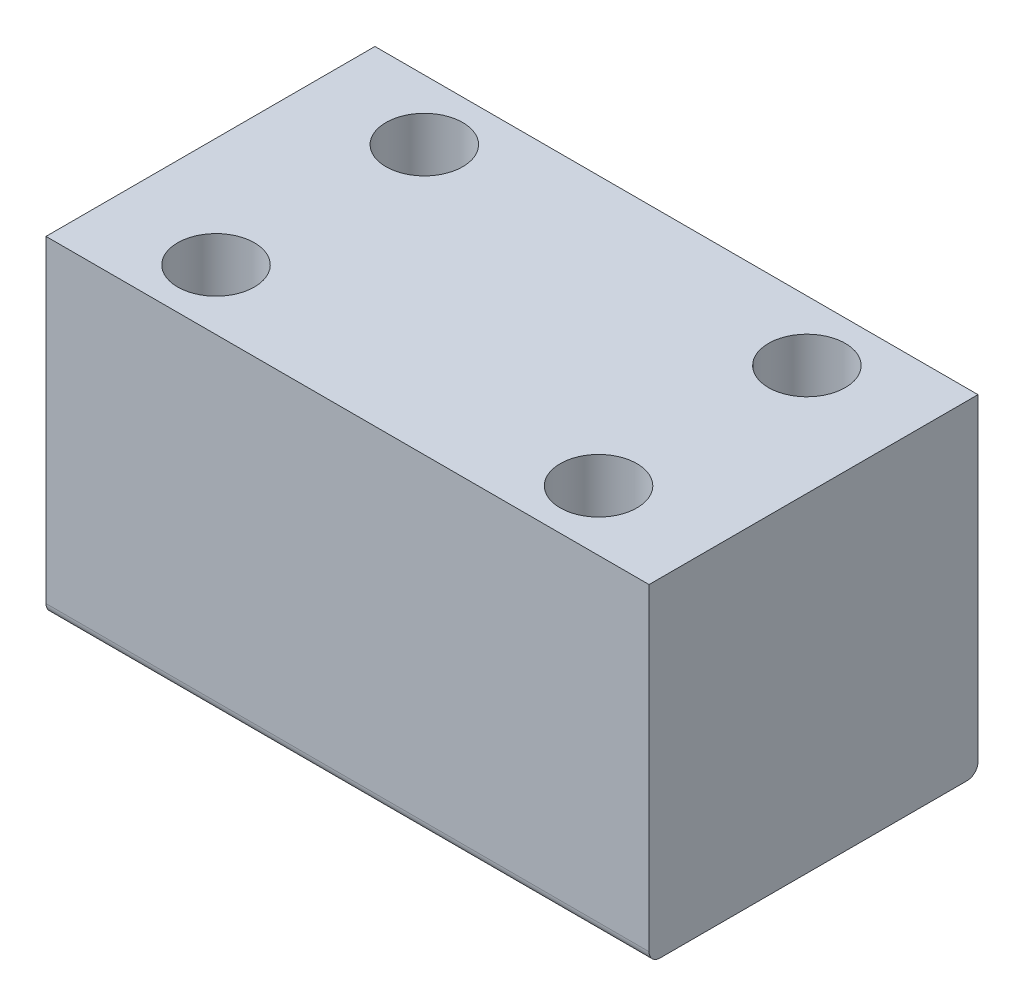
ISO-10303-21;
HEADER;
FILE_DESCRIPTION(('STEP AP214'),'2;1');
FILE_NAME('part.step','',(''),(''),'','','');
FILE_SCHEMA(('AUTOMOTIVE_DESIGN { 1 0 10303 214 1 1 1 1 }'));
ENDSEC;
DATA;
#1=APPLICATION_CONTEXT('core data for automotive mechanical design processes');
#2=APPLICATION_PROTOCOL_DEFINITION('international standard','automotive_design',2000,#1);
#3=PRODUCT_CONTEXT('',#1,'mechanical');
#4=PRODUCT('Part','Part','',(#3));
#5=PRODUCT_RELATED_PRODUCT_CATEGORY('part','',(#4));
#6=PRODUCT_DEFINITION_FORMATION('','',#4);
#7=PRODUCT_DEFINITION_CONTEXT('part definition',#1,'design');
#8=PRODUCT_DEFINITION('design','',#6,#7);
#9=PRODUCT_DEFINITION_SHAPE('','',#8);
#10=(LENGTH_UNIT() NAMED_UNIT(*) SI_UNIT(.MILLI.,.METRE.));
#11=(NAMED_UNIT(*) PLANE_ANGLE_UNIT() SI_UNIT($,.RADIAN.));
#12=(NAMED_UNIT(*) SI_UNIT($,.STERADIAN.) SOLID_ANGLE_UNIT());
#13=UNCERTAINTY_MEASURE_WITH_UNIT(LENGTH_MEASURE(1.E-05),#10,'distance_accuracy_value','');
#14=(GEOMETRIC_REPRESENTATION_CONTEXT(3) GLOBAL_UNCERTAINTY_ASSIGNED_CONTEXT((#13)) GLOBAL_UNIT_ASSIGNED_CONTEXT((#10,
#11,#12)) REPRESENTATION_CONTEXT('',''));
#15=CARTESIAN_POINT('',(0.,0.,0.));
#16=DIRECTION('',(0.,0.,1.));
#17=DIRECTION('',(1.,0.,0.));
#18=AXIS2_PLACEMENT_3D('',#15,#16,#17);
#19=CARTESIAN_POINT('',(55.,-15.,15.));
#20=DIRECTION('',(0.,1.,0.));
#21=DIRECTION('',(0.,0.,1.));
#22=AXIS2_PLACEMENT_3D('',#19,#20,#21);
#23=PLANE('',#22);
#24=DIRECTION('',(0.,0.,-1.));
#25=VECTOR('',#24,1.);
#26=CARTESIAN_POINT('',(0.,-15.,15.));
#27=LINE('',#26,#25);
#28=CARTESIAN_POINT('',(0.,-15.,14.));
#29=VERTEX_POINT('',#28);
#30=CARTESIAN_POINT('',(0.,-15.,-14.));
#31=VERTEX_POINT('',#30);
#32=EDGE_CURVE('E141',#29,#31,#27,.T.);
#33=ORIENTED_EDGE('',*,*,#32,.T.);
#34=DIRECTION('',(-1.,0.,0.));
#35=VECTOR('',#34,1.);
#36=CARTESIAN_POINT('',(55.,-15.,-14.));
#37=LINE('',#36,#35);
#38=CARTESIAN_POINT('',(55.,-15.,-14.));
#39=VERTEX_POINT('',#38);
#40=EDGE_CURVE('E44',#31,#39,#37,.F.);
#41=ORIENTED_EDGE('',*,*,#40,.T.);
#42=DIRECTION('',(0.,0.,-1.));
#43=VECTOR('',#42,1.);
#44=CARTESIAN_POINT('',(55.,-15.,15.));
#45=LINE('',#44,#43);
#46=CARTESIAN_POINT('',(55.,-15.,14.));
#47=VERTEX_POINT('',#46);
#48=EDGE_CURVE('E142',#47,#39,#45,.T.);
#49=ORIENTED_EDGE('',*,*,#48,.F.);
#50=DIRECTION('',(-1.,0.,0.));
#51=VECTOR('',#50,1.);
#52=CARTESIAN_POINT('',(0.,-15.,14.));
#53=LINE('',#52,#51);
#54=EDGE_CURVE('E165',#47,#29,#53,.T.);
#55=ORIENTED_EDGE('',*,*,#54,.T.);
#56=EDGE_LOOP('',(#33,#41,#49,#55));
#57=FACE_BOUND('',#56,.T.);
#58=ADVANCED_FACE('F36',(#57),#23,.F.);
#59=CARTESIAN_POINT('',(55.,-15.,-15.));
#60=DIRECTION('',(0.,0.,1.));
#61=DIRECTION('',(1.,0.,0.));
#62=AXIS2_PLACEMENT_3D('',#59,#60,#61);
#63=PLANE('',#62);
#64=DIRECTION('',(0.,1.,0.));
#65=VECTOR('',#64,1.);
#66=CARTESIAN_POINT('',(55.,-15.,-15.));
#67=LINE('',#66,#65);
#68=CARTESIAN_POINT('',(55.,-14.,-15.));
#69=VERTEX_POINT('',#68);
#70=CARTESIAN_POINT('',(55.,15.,-15.));
#71=VERTEX_POINT('',#70);
#72=EDGE_CURVE('E144',#69,#71,#67,.T.);
#73=ORIENTED_EDGE('',*,*,#72,.F.);
#74=DIRECTION('',(-1.,0.,0.));
#75=VECTOR('',#74,1.);
#76=CARTESIAN_POINT('',(55.,-14.,-15.));
#77=LINE('',#76,#75);
#78=CARTESIAN_POINT('',(0.,-14.,-15.));
#79=VERTEX_POINT('',#78);
#80=EDGE_CURVE('E174',#69,#79,#77,.T.);
#81=ORIENTED_EDGE('',*,*,#80,.T.);
#82=DIRECTION('',(0.,1.,0.));
#83=VECTOR('',#82,1.);
#84=CARTESIAN_POINT('',(0.,-15.,-15.));
#85=LINE('',#84,#83);
#86=CARTESIAN_POINT('',(0.,15.,-15.));
#87=VERTEX_POINT('',#86);
#88=EDGE_CURVE('E154',#79,#87,#85,.T.);
#89=ORIENTED_EDGE('',*,*,#88,.T.);
#90=DIRECTION('',(-1.,0.,0.));
#91=VECTOR('',#90,1.);
#92=CARTESIAN_POINT('',(55.,15.,-15.));
#93=LINE('',#92,#91);
#94=EDGE_CURVE('E162',#71,#87,#93,.T.);
#95=ORIENTED_EDGE('',*,*,#94,.F.);
#96=EDGE_LOOP('',(#73,#81,#89,#95));
#97=FACE_BOUND('',#96,.T.);
#98=ADVANCED_FACE('F180',(#97),#63,.F.);
#99=CARTESIAN_POINT('',(55.,15.,15.));
#100=DIRECTION('',(0.,1.,0.));
#101=DIRECTION('',(0.,0.,1.));
#102=AXIS2_PLACEMENT_3D('',#99,#100,#101);
#103=PLANE('',#102);
#104=CARTESIAN_POINT('',(10.0050881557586,15.,-9.5));
#105=DIRECTION('',(0.,1.,0.));
#106=DIRECTION('',(0.,0.,1.));
#107=AXIS2_PLACEMENT_3D('',#104,#105,#106);
#108=CIRCLE('',#107,3.49999999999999);
#109=CARTESIAN_POINT('',(10.0050881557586,15.,-6.00000000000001));
#110=VERTEX_POINT('',#109);
#111=EDGE_CURVE('E113',#110,#110,#108,.T.);
#112=ORIENTED_EDGE('',*,*,#111,.F.);
#113=EDGE_LOOP('',(#112));
#114=FACE_BOUND('',#113,.T.);
#115=CARTESIAN_POINT('',(10.0050881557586,15.,9.5));
#116=DIRECTION('',(0.,1.,0.));
#117=DIRECTION('',(0.,0.,1.));
#118=AXIS2_PLACEMENT_3D('',#115,#116,#117);
#119=CIRCLE('',#118,3.49999999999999);
#120=CARTESIAN_POINT('',(10.0050881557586,15.,13.));
#121=VERTEX_POINT('',#120);
#122=EDGE_CURVE('E112',#121,#121,#119,.T.);
#123=ORIENTED_EDGE('',*,*,#122,.F.);
#124=EDGE_LOOP('',(#123));
#125=FACE_BOUND('',#124,.T.);
#126=CARTESIAN_POINT('',(44.8952061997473,15.,9.5));
#127=DIRECTION('',(0.,1.,0.));
#128=DIRECTION('',(0.,0.,1.));
#129=AXIS2_PLACEMENT_3D('',#126,#127,#128);
#130=CIRCLE('',#129,3.49999999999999);
#131=CARTESIAN_POINT('',(44.8952061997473,15.,13.));
#132=VERTEX_POINT('',#131);
#133=EDGE_CURVE('E123',#132,#132,#130,.T.);
#134=ORIENTED_EDGE('',*,*,#133,.F.);
#135=EDGE_LOOP('',(#134));
#136=FACE_BOUND('',#135,.T.);
#137=CARTESIAN_POINT('',(44.8952061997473,15.,-9.5));
#138=DIRECTION('',(0.,1.,0.));
#139=DIRECTION('',(0.,0.,1.));
#140=AXIS2_PLACEMENT_3D('',#137,#138,#139);
#141=CIRCLE('',#140,3.49999999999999);
#142=CARTESIAN_POINT('',(44.8952061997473,15.,-6.00000000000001));
#143=VERTEX_POINT('',#142);
#144=EDGE_CURVE('E129',#143,#143,#141,.T.);
#145=ORIENTED_EDGE('',*,*,#144,.F.);
#146=EDGE_LOOP('',(#145));
#147=FACE_BOUND('',#146,.T.);
#148=DIRECTION('',(0.,0.,-1.));
#149=VECTOR('',#148,1.);
#150=CARTESIAN_POINT('',(0.,15.,15.));
#151=LINE('',#150,#149);
#152=CARTESIAN_POINT('',(0.,15.,15.));
#153=VERTEX_POINT('',#152);
#154=EDGE_CURVE('E156',#153,#87,#151,.T.);
#155=ORIENTED_EDGE('',*,*,#154,.F.);
#156=DIRECTION('',(-1.,0.,0.));
#157=VECTOR('',#156,1.);
#158=CARTESIAN_POINT('',(55.,15.,15.));
#159=LINE('',#158,#157);
#160=CARTESIAN_POINT('',(55.,15.,15.));
#161=VERTEX_POINT('',#160);
#162=EDGE_CURVE('E152',#161,#153,#159,.T.);
#163=ORIENTED_EDGE('',*,*,#162,.F.);
#164=DIRECTION('',(0.,0.,-1.));
#165=VECTOR('',#164,1.);
#166=CARTESIAN_POINT('',(55.,15.,15.));
#167=LINE('',#166,#165);
#168=EDGE_CURVE('E147',#161,#71,#167,.T.);
#169=ORIENTED_EDGE('',*,*,#168,.T.);
#170=ORIENTED_EDGE('',*,*,#94,.T.);
#171=EDGE_LOOP('',(#155,#163,#169,#170));
#172=FACE_BOUND('',#171,.T.);
#173=ADVANCED_FACE('F189',(#114,#125,#136,#147,#172),#103,.T.);
#174=CARTESIAN_POINT('',(55.,-15.,15.));
#175=DIRECTION('',(0.,0.,1.));
#176=DIRECTION('',(1.,0.,0.));
#177=AXIS2_PLACEMENT_3D('',#174,#175,#176);
#178=PLANE('',#177);
#179=DIRECTION('',(0.,1.,0.));
#180=VECTOR('',#179,1.);
#181=CARTESIAN_POINT('',(0.,-15.,15.));
#182=LINE('',#181,#180);
#183=CARTESIAN_POINT('',(0.,-14.,15.));
#184=VERTEX_POINT('',#183);
#185=EDGE_CURVE('E145',#184,#153,#182,.T.);
#186=ORIENTED_EDGE('',*,*,#185,.F.);
#187=DIRECTION('',(-1.,0.,0.));
#188=VECTOR('',#187,1.);
#189=CARTESIAN_POINT('',(55.,-14.,15.));
#190=LINE('',#189,#188);
#191=CARTESIAN_POINT('',(55.,-14.,15.));
#192=VERTEX_POINT('',#191);
#193=EDGE_CURVE('E170',#184,#192,#190,.F.);
#194=ORIENTED_EDGE('',*,*,#193,.T.);
#195=DIRECTION('',(0.,1.,0.));
#196=VECTOR('',#195,1.);
#197=CARTESIAN_POINT('',(55.,-15.,15.));
#198=LINE('',#197,#196);
#199=EDGE_CURVE('E150',#192,#161,#198,.T.);
#200=ORIENTED_EDGE('',*,*,#199,.T.);
#201=ORIENTED_EDGE('',*,*,#162,.T.);
#202=EDGE_LOOP('',(#186,#194,#200,#201));
#203=FACE_BOUND('',#202,.T.);
#204=ADVANCED_FACE('F210',(#203),#178,.T.);
#205=CARTESIAN_POINT('',(55.,0.,0.));
#206=DIRECTION('',(1.,0.,0.));
#207=DIRECTION('',(0.,0.,-1.));
#208=AXIS2_PLACEMENT_3D('',#205,#206,#207);
#209=PLANE('',#208);
#210=ORIENTED_EDGE('',*,*,#48,.T.);
#211=CARTESIAN_POINT('',(55.,-14.,-14.));
#212=DIRECTION('',(1.,0.,0.));
#213=DIRECTION('',(0.,0.,-1.));
#214=AXIS2_PLACEMENT_3D('',#211,#212,#213);
#215=CIRCLE('',#214,1.);
#216=EDGE_CURVE('E11',#39,#69,#215,.T.);
#217=ORIENTED_EDGE('',*,*,#216,.T.);
#218=ORIENTED_EDGE('',*,*,#72,.T.);
#219=ORIENTED_EDGE('',*,*,#168,.F.);
#220=ORIENTED_EDGE('',*,*,#199,.F.);
#221=CARTESIAN_POINT('',(55.,-14.,14.));
#222=DIRECTION('',(1.,0.,0.));
#223=DIRECTION('',(0.,0.,-1.));
#224=AXIS2_PLACEMENT_3D('',#221,#222,#223);
#225=CIRCLE('',#224,1.);
#226=EDGE_CURVE('E172',#192,#47,#225,.T.);
#227=ORIENTED_EDGE('',*,*,#226,.T.);
#228=EDGE_LOOP('',(#210,#217,#218,#219,#220,#227));
#229=FACE_BOUND('',#228,.T.);
#230=ADVANCED_FACE('F193',(#229),#209,.T.);
#231=CARTESIAN_POINT('',(0.,0.,0.));
#232=DIRECTION('',(1.,0.,0.));
#233=DIRECTION('',(0.,0.,-1.));
#234=AXIS2_PLACEMENT_3D('',#231,#232,#233);
#235=PLANE('',#234);
#236=CARTESIAN_POINT('',(0.,0.,0.));
#237=DIRECTION('',(-1.,0.,0.));
#238=DIRECTION('',(0.,0.,1.));
#239=AXIS2_PLACEMENT_3D('',#236,#237,#238);
#240=CIRCLE('',#239,3.49999999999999);
#241=CARTESIAN_POINT('',(0.,0.,3.49999999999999));
#242=VERTEX_POINT('',#241);
#243=EDGE_CURVE('E135',#242,#242,#240,.T.);
#244=ORIENTED_EDGE('',*,*,#243,.F.);
#245=EDGE_LOOP('',(#244));
#246=FACE_BOUND('',#245,.T.);
#247=ORIENTED_EDGE('',*,*,#88,.F.);
#248=CARTESIAN_POINT('',(0.,-14.,-14.));
#249=DIRECTION('',(1.,0.,0.));
#250=DIRECTION('',(0.,0.,-1.));
#251=AXIS2_PLACEMENT_3D('',#248,#249,#250);
#252=CIRCLE('',#251,1.);
#253=EDGE_CURVE('E58',#79,#31,#252,.F.);
#254=ORIENTED_EDGE('',*,*,#253,.T.);
#255=ORIENTED_EDGE('',*,*,#32,.F.);
#256=CARTESIAN_POINT('',(0.,-14.,14.));
#257=DIRECTION('',(1.,0.,0.));
#258=DIRECTION('',(0.,0.,-1.));
#259=AXIS2_PLACEMENT_3D('',#256,#257,#258);
#260=CIRCLE('',#259,1.);
#261=EDGE_CURVE('E168',#29,#184,#260,.F.);
#262=ORIENTED_EDGE('',*,*,#261,.T.);
#263=ORIENTED_EDGE('',*,*,#185,.T.);
#264=ORIENTED_EDGE('',*,*,#154,.T.);
#265=EDGE_LOOP('',(#247,#254,#255,#262,#263,#264));
#266=FACE_BOUND('',#265,.T.);
#267=ADVANCED_FACE('F184',(#246,#266),#235,.F.);
#268=CARTESIAN_POINT('',(31.,0.,0.));
#269=DIRECTION('',(-1.,0.,0.));
#270=DIRECTION('',(0.,0.,1.));
#271=AXIS2_PLACEMENT_3D('',#268,#269,#270);
#272=CONICAL_SURFACE('',#271,3.49999999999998,1.02974425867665);
#273=CARTESIAN_POINT('',(33.1030121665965,0.,0.));
#274=VERTEX_POINT('',#273);
#275=VERTEX_LOOP('',#274);
#276=FACE_BOUND('',#275,.T.);
#277=CARTESIAN_POINT('',(31.,0.,0.));
#278=DIRECTION('',(-1.,0.,0.));
#279=DIRECTION('',(0.,0.,1.));
#280=AXIS2_PLACEMENT_3D('',#277,#278,#279);
#281=CIRCLE('',#280,3.49999999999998);
#282=CARTESIAN_POINT('',(31.,0.,3.49999999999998));
#283=VERTEX_POINT('',#282);
#284=EDGE_CURVE('E138',#283,#283,#281,.T.);
#285=ORIENTED_EDGE('',*,*,#284,.T.);
#286=EDGE_LOOP('',(#285));
#287=FACE_BOUND('',#286,.T.);
#288=ADVANCED_FACE('F217',(#276,#287),#272,.F.);
#289=CARTESIAN_POINT('',(0.,0.,0.));
#290=DIRECTION('',(-1.,0.,0.));
#291=DIRECTION('',(0.,0.,1.));
#292=AXIS2_PLACEMENT_3D('',#289,#290,#291);
#293=CYLINDRICAL_SURFACE('',#292,3.49999999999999);
#294=ORIENTED_EDGE('',*,*,#284,.F.);
#295=EDGE_LOOP('',(#294));
#296=FACE_BOUND('',#295,.T.);
#297=ORIENTED_EDGE('',*,*,#243,.T.);
#298=EDGE_LOOP('',(#297));
#299=FACE_BOUND('',#298,.T.);
#300=ADVANCED_FACE('F223',(#296,#299),#293,.F.);
#301=CARTESIAN_POINT('',(44.8952061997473,-6.,-9.5));
#302=DIRECTION('',(0.,1.,0.));
#303=DIRECTION('',(0.,0.,1.));
#304=AXIS2_PLACEMENT_3D('',#301,#302,#303);
#305=CONICAL_SURFACE('',#304,3.5,1.02974425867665);
#306=CARTESIAN_POINT('',(44.8952061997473,-8.10301216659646,-9.5));
#307=VERTEX_POINT('',#306);
#308=VERTEX_LOOP('',#307);
#309=FACE_BOUND('',#308,.T.);
#310=CARTESIAN_POINT('',(44.8952061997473,-6.,-9.5));
#311=DIRECTION('',(0.,1.,0.));
#312=DIRECTION('',(0.,0.,1.));
#313=AXIS2_PLACEMENT_3D('',#310,#311,#312);
#314=CIRCLE('',#313,3.5);
#315=CARTESIAN_POINT('',(44.8952061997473,-6.,-6.));
#316=VERTEX_POINT('',#315);
#317=EDGE_CURVE('E132',#316,#316,#314,.T.);
#318=ORIENTED_EDGE('',*,*,#317,.T.);
#319=EDGE_LOOP('',(#318));
#320=FACE_BOUND('',#319,.T.);
#321=ADVANCED_FACE('F227',(#309,#320),#305,.F.);
#322=CARTESIAN_POINT('',(44.8952061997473,15.,-9.5));
#323=DIRECTION('',(0.,1.,0.));
#324=DIRECTION('',(0.,0.,1.));
#325=AXIS2_PLACEMENT_3D('',#322,#323,#324);
#326=CYLINDRICAL_SURFACE('',#325,3.49999999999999);
#327=ORIENTED_EDGE('',*,*,#317,.F.);
#328=EDGE_LOOP('',(#327));
#329=FACE_BOUND('',#328,.T.);
#330=ORIENTED_EDGE('',*,*,#144,.T.);
#331=EDGE_LOOP('',(#330));
#332=FACE_BOUND('',#331,.T.);
#333=ADVANCED_FACE('F231',(#329,#332),#326,.F.);
#334=CARTESIAN_POINT('',(44.8952061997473,-6.,9.5));
#335=DIRECTION('',(0.,1.,0.));
#336=DIRECTION('',(0.,0.,1.));
#337=AXIS2_PLACEMENT_3D('',#334,#335,#336);
#338=CONICAL_SURFACE('',#337,3.5,1.02974425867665);
#339=CARTESIAN_POINT('',(44.8952061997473,-8.10301216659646,9.5));
#340=VERTEX_POINT('',#339);
#341=VERTEX_LOOP('',#340);
#342=FACE_BOUND('',#341,.T.);
#343=CARTESIAN_POINT('',(44.8952061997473,-6.,9.5));
#344=DIRECTION('',(0.,1.,0.));
#345=DIRECTION('',(0.,0.,1.));
#346=AXIS2_PLACEMENT_3D('',#343,#344,#345);
#347=CIRCLE('',#346,3.5);
#348=CARTESIAN_POINT('',(44.8952061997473,-6.,13.));
#349=VERTEX_POINT('',#348);
#350=EDGE_CURVE('E126',#349,#349,#347,.T.);
#351=ORIENTED_EDGE('',*,*,#350,.T.);
#352=EDGE_LOOP('',(#351));
#353=FACE_BOUND('',#352,.T.);
#354=ADVANCED_FACE('F235',(#342,#353),#338,.F.);
#355=CARTESIAN_POINT('',(44.8952061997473,15.,9.5));
#356=DIRECTION('',(0.,1.,0.));
#357=DIRECTION('',(0.,0.,1.));
#358=AXIS2_PLACEMENT_3D('',#355,#356,#357);
#359=CYLINDRICAL_SURFACE('',#358,3.49999999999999);
#360=ORIENTED_EDGE('',*,*,#350,.F.);
#361=EDGE_LOOP('',(#360));
#362=FACE_BOUND('',#361,.T.);
#363=ORIENTED_EDGE('',*,*,#133,.T.);
#364=EDGE_LOOP('',(#363));
#365=FACE_BOUND('',#364,.T.);
#366=ADVANCED_FACE('F239',(#362,#365),#359,.F.);
#367=CARTESIAN_POINT('',(10.0050881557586,-6.,9.5));
#368=DIRECTION('',(0.,1.,0.));
#369=DIRECTION('',(0.,0.,1.));
#370=AXIS2_PLACEMENT_3D('',#367,#368,#369);
#371=CONICAL_SURFACE('',#370,3.49999999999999,1.02974425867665);
#372=CARTESIAN_POINT('',(10.0050881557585,-8.10301216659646,9.5));
#373=VERTEX_POINT('',#372);
#374=VERTEX_LOOP('',#373);
#375=FACE_BOUND('',#374,.T.);
#376=CARTESIAN_POINT('',(10.0050881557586,-6.,9.5));
#377=DIRECTION('',(0.,1.,0.));
#378=DIRECTION('',(0.,0.,1.));
#379=AXIS2_PLACEMENT_3D('',#376,#377,#378);
#380=CIRCLE('',#379,3.49999999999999);
#381=CARTESIAN_POINT('',(10.0050881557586,-6.,13.));
#382=VERTEX_POINT('',#381);
#383=EDGE_CURVE('E116',#382,#382,#380,.T.);
#384=ORIENTED_EDGE('',*,*,#383,.T.);
#385=EDGE_LOOP('',(#384));
#386=FACE_BOUND('',#385,.T.);
#387=ADVANCED_FACE('F243',(#375,#386),#371,.F.);
#388=CARTESIAN_POINT('',(10.0050881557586,15.,9.5));
#389=DIRECTION('',(0.,1.,0.));
#390=DIRECTION('',(0.,0.,1.));
#391=AXIS2_PLACEMENT_3D('',#388,#389,#390);
#392=CYLINDRICAL_SURFACE('',#391,3.49999999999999);
#393=ORIENTED_EDGE('',*,*,#383,.F.);
#394=EDGE_LOOP('',(#393));
#395=FACE_BOUND('',#394,.T.);
#396=ORIENTED_EDGE('',*,*,#122,.T.);
#397=EDGE_LOOP('',(#396));
#398=FACE_BOUND('',#397,.T.);
#399=ADVANCED_FACE('F106',(#395,#398),#392,.F.);
#400=CARTESIAN_POINT('',(10.0050881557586,-6.,-9.5));
#401=DIRECTION('',(0.,1.,0.));
#402=DIRECTION('',(0.,0.,1.));
#403=AXIS2_PLACEMENT_3D('',#400,#401,#402);
#404=CONICAL_SURFACE('',#403,3.49999999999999,1.02974425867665);
#405=CARTESIAN_POINT('',(10.0050881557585,-8.10301216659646,-9.5));
#406=VERTEX_POINT('',#405);
#407=VERTEX_LOOP('',#406);
#408=FACE_BOUND('',#407,.T.);
#409=CARTESIAN_POINT('',(10.0050881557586,-6.,-9.5));
#410=DIRECTION('',(0.,1.,0.));
#411=DIRECTION('',(0.,0.,1.));
#412=AXIS2_PLACEMENT_3D('',#409,#410,#411);
#413=CIRCLE('',#412,3.49999999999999);
#414=CARTESIAN_POINT('',(10.0050881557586,-6.,-6.00000000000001));
#415=VERTEX_POINT('',#414);
#416=EDGE_CURVE('E110',#415,#415,#413,.T.);
#417=ORIENTED_EDGE('',*,*,#416,.T.);
#418=EDGE_LOOP('',(#417));
#419=FACE_BOUND('',#418,.T.);
#420=ADVANCED_FACE('F102',(#408,#419),#404,.F.);
#421=CARTESIAN_POINT('',(10.0050881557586,15.,-9.5));
#422=DIRECTION('',(0.,1.,0.));
#423=DIRECTION('',(0.,0.,1.));
#424=AXIS2_PLACEMENT_3D('',#421,#422,#423);
#425=CYLINDRICAL_SURFACE('',#424,3.49999999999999);
#426=ORIENTED_EDGE('',*,*,#416,.F.);
#427=EDGE_LOOP('',(#426));
#428=FACE_BOUND('',#427,.T.);
#429=ORIENTED_EDGE('',*,*,#111,.T.);
#430=EDGE_LOOP('',(#429));
#431=FACE_BOUND('',#430,.T.);
#432=ADVANCED_FACE('F105',(#428,#431),#425,.F.);
#433=CARTESIAN_POINT('',(55.,-14.,14.));
#434=DIRECTION('',(1.,0.,0.));
#435=DIRECTION('',(0.,0.,-1.));
#436=AXIS2_PLACEMENT_3D('',#433,#434,#435);
#437=CYLINDRICAL_SURFACE('',#436,1.);
#438=ORIENTED_EDGE('',*,*,#226,.F.);
#439=ORIENTED_EDGE('',*,*,#193,.F.);
#440=ORIENTED_EDGE('',*,*,#261,.F.);
#441=ORIENTED_EDGE('',*,*,#54,.F.);
#442=EDGE_LOOP('',(#438,#439,#440,#441));
#443=FACE_BOUND('',#442,.T.);
#444=ADVANCED_FACE('F196',(#443),#437,.T.);
#445=CARTESIAN_POINT('',(55.,-14.,-14.));
#446=DIRECTION('',(-1.,0.,0.));
#447=DIRECTION('',(0.,0.,1.));
#448=AXIS2_PLACEMENT_3D('',#445,#446,#447);
#449=CYLINDRICAL_SURFACE('',#448,1.);
#450=ORIENTED_EDGE('',*,*,#216,.F.);
#451=ORIENTED_EDGE('',*,*,#40,.F.);
#452=ORIENTED_EDGE('',*,*,#253,.F.);
#453=ORIENTED_EDGE('',*,*,#80,.F.);
#454=EDGE_LOOP('',(#450,#451,#452,#453));
#455=FACE_BOUND('',#454,.T.);
#456=ADVANCED_FACE('F38',(#455),#449,.T.);
#457=CLOSED_SHELL('',(#58,#98,#173,#204,#230,#267,#288,#300,#321,#333,#354,#366,#387,#399,#420,
#432,#444,#456));
#458=MANIFOLD_SOLID_BREP('B2',#457);
#459=ADVANCED_BREP_SHAPE_REPRESENTATION('',(#18,#458),#14);
#460=SHAPE_DEFINITION_REPRESENTATION(#9,#459);
ENDSEC;
END-ISO-10303-21;
